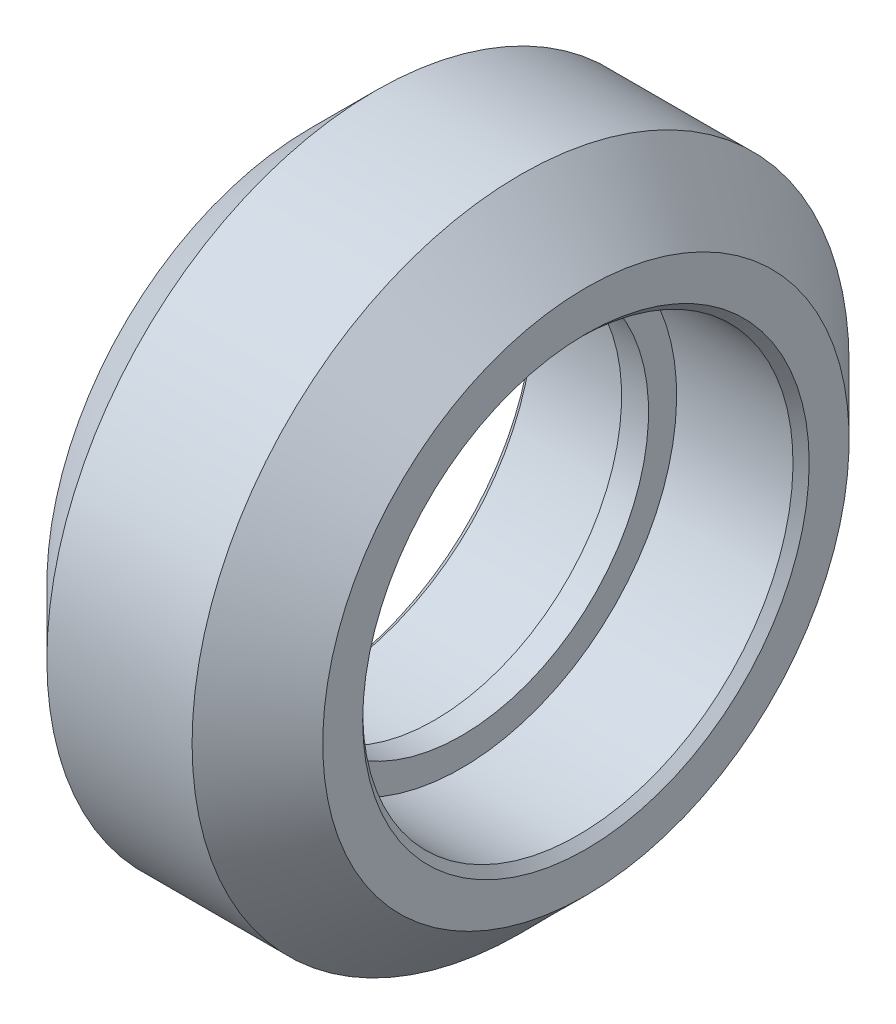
ISO-10303-21;
HEADER;
FILE_DESCRIPTION(('STEP AP214'),'2;1');
FILE_NAME('part.step','',(''),(''),'','','');
FILE_SCHEMA(('AUTOMOTIVE_DESIGN { 1 0 10303 214 1 1 1 1 }'));
ENDSEC;
DATA;
#1=APPLICATION_CONTEXT('core data for automotive mechanical design processes');
#2=APPLICATION_PROTOCOL_DEFINITION('international standard','automotive_design',2000,#1);
#3=PRODUCT_CONTEXT('',#1,'mechanical');
#4=PRODUCT('Part','Part','',(#3));
#5=PRODUCT_RELATED_PRODUCT_CATEGORY('part','',(#4));
#6=PRODUCT_DEFINITION_FORMATION('','',#4);
#7=PRODUCT_DEFINITION_CONTEXT('part definition',#1,'design');
#8=PRODUCT_DEFINITION('design','',#6,#7);
#9=PRODUCT_DEFINITION_SHAPE('','',#8);
#10=(LENGTH_UNIT() NAMED_UNIT(*) SI_UNIT(.MILLI.,.METRE.));
#11=(NAMED_UNIT(*) PLANE_ANGLE_UNIT() SI_UNIT($,.RADIAN.));
#12=(NAMED_UNIT(*) SI_UNIT($,.STERADIAN.) SOLID_ANGLE_UNIT());
#13=UNCERTAINTY_MEASURE_WITH_UNIT(LENGTH_MEASURE(1.E-05),#10,'distance_accuracy_value','');
#14=(GEOMETRIC_REPRESENTATION_CONTEXT(3) GLOBAL_UNCERTAINTY_ASSIGNED_CONTEXT((#13)) GLOBAL_UNIT_ASSIGNED_CONTEXT((#10,
#11,#12)) REPRESENTATION_CONTEXT('',''));
#15=CARTESIAN_POINT('',(0.,0.,0.));
#16=DIRECTION('',(0.,0.,1.));
#17=DIRECTION('',(1.,0.,0.));
#18=AXIS2_PLACEMENT_3D('',#15,#16,#17);
#19=CARTESIAN_POINT('',(-0.25,0.,0.));
#20=DIRECTION('',(-1.,0.,0.));
#21=DIRECTION('',(0.,1.,0.));
#22=AXIS2_PLACEMENT_3D('',#19,#20,#21);
#23=CYLINDRICAL_SURFACE('',#22,6.945);
#24=CARTESIAN_POINT('',(-0.499999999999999,0.,0.));
#25=DIRECTION('',(1.,0.,0.));
#26=DIRECTION('',(0.,1.,0.));
#27=AXIS2_PLACEMENT_3D('',#24,#25,#26);
#28=CIRCLE('',#27,6.945);
#29=CARTESIAN_POINT('',(-0.499999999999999,6.945,0.));
#30=VERTEX_POINT('',#29);
#31=EDGE_CURVE('E26',#30,#30,#28,.T.);
#32=ORIENTED_EDGE('',*,*,#31,.F.);
#33=EDGE_LOOP('',(#32));
#34=FACE_BOUND('',#33,.T.);
#35=CARTESIAN_POINT('',(0.499999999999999,0.,0.));
#36=DIRECTION('',(1.,0.,0.));
#37=DIRECTION('',(0.,1.,0.));
#38=AXIS2_PLACEMENT_3D('',#35,#36,#37);
#39=CIRCLE('',#38,6.945);
#40=CARTESIAN_POINT('',(0.499999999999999,6.945,0.));
#41=VERTEX_POINT('',#40);
#42=EDGE_CURVE('E11',#41,#41,#39,.T.);
#43=ORIENTED_EDGE('',*,*,#42,.T.);
#44=EDGE_LOOP('',(#43));
#45=FACE_BOUND('',#44,.T.);
#46=ADVANCED_FACE('F16',(#34,#45),#23,.F.);
#47=CARTESIAN_POINT('',(-0.499999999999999,7.466,0.));
#48=DIRECTION('',(-1.,0.,0.));
#49=DIRECTION('',(0.,0.707106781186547,0.707106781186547));
#50=AXIS2_PLACEMENT_3D('',#47,#48,#49);
#51=PLANE('',#50);
#52=CARTESIAN_POINT('',(-0.499999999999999,0.,0.));
#53=DIRECTION('',(1.,0.,0.));
#54=DIRECTION('',(0.,1.,0.));
#55=AXIS2_PLACEMENT_3D('',#52,#53,#54);
#56=CIRCLE('',#55,7.987);
#57=CARTESIAN_POINT('',(-0.499999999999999,7.987,0.));
#58=VERTEX_POINT('',#57);
#59=EDGE_CURVE('E256',#58,#58,#56,.T.);
#60=ORIENTED_EDGE('',*,*,#59,.F.);
#61=EDGE_LOOP('',(#60));
#62=FACE_BOUND('',#61,.T.);
#63=ORIENTED_EDGE('',*,*,#31,.T.);
#64=EDGE_LOOP('',(#63));
#65=FACE_BOUND('',#64,.T.);
#66=ADVANCED_FACE('F108',(#62,#65),#51,.T.);
#67=CARTESIAN_POINT('',(-2.66,0.,0.));
#68=DIRECTION('',(-1.,0.,0.));
#69=DIRECTION('',(0.,1.,0.));
#70=AXIS2_PLACEMENT_3D('',#67,#68,#69);
#71=CYLINDRICAL_SURFACE('',#70,7.987);
#72=CARTESIAN_POINT('',(-4.82,0.,0.));
#73=DIRECTION('',(1.,0.,0.));
#74=DIRECTION('',(0.,1.,0.));
#75=AXIS2_PLACEMENT_3D('',#72,#73,#74);
#76=CIRCLE('',#75,7.987);
#77=CARTESIAN_POINT('',(-4.82,7.987,0.));
#78=VERTEX_POINT('',#77);
#79=EDGE_CURVE('E253',#78,#78,#76,.T.);
#80=ORIENTED_EDGE('',*,*,#79,.F.);
#81=EDGE_LOOP('',(#80));
#82=FACE_BOUND('',#81,.T.);
#83=ORIENTED_EDGE('',*,*,#59,.T.);
#84=EDGE_LOOP('',(#83));
#85=FACE_BOUND('',#84,.T.);
#86=ADVANCED_FACE('F113',(#82,#85),#71,.F.);
#87=CARTESIAN_POINT('',(-4.97,0.,0.));
#88=DIRECTION('',(-1.,0.,0.));
#89=DIRECTION('',(0.,1.,0.));
#90=AXIS2_PLACEMENT_3D('',#87,#88,#89);
#91=CONICAL_SURFACE('',#90,8.137,0.785398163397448);
#92=CARTESIAN_POINT('',(-5.12,0.,0.));
#93=DIRECTION('',(1.,0.,0.));
#94=DIRECTION('',(0.,1.,0.));
#95=AXIS2_PLACEMENT_3D('',#92,#93,#94);
#96=CIRCLE('',#95,8.287);
#97=CARTESIAN_POINT('',(-5.12,8.287,0.));
#98=VERTEX_POINT('',#97);
#99=EDGE_CURVE('E251',#98,#98,#96,.T.);
#100=ORIENTED_EDGE('',*,*,#99,.F.);
#101=EDGE_LOOP('',(#100));
#102=FACE_BOUND('',#101,.T.);
#103=ORIENTED_EDGE('',*,*,#79,.T.);
#104=EDGE_LOOP('',(#103));
#105=FACE_BOUND('',#104,.T.);
#106=ADVANCED_FACE('F120',(#102,#105),#91,.F.);
#107=CARTESIAN_POINT('',(-5.12,9.0285,0.));
#108=DIRECTION('',(-1.,0.,0.));
#109=DIRECTION('',(0.,0.707106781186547,0.707106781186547));
#110=AXIS2_PLACEMENT_3D('',#107,#108,#109);
#111=PLANE('',#110);
#112=CARTESIAN_POINT('',(-5.12,0.,0.));
#113=DIRECTION('',(1.,0.,0.));
#114=DIRECTION('',(0.,1.,0.));
#115=AXIS2_PLACEMENT_3D('',#112,#113,#114);
#116=CIRCLE('',#115,9.77);
#117=CARTESIAN_POINT('',(-5.12,9.77,0.));
#118=VERTEX_POINT('',#117);
#119=EDGE_CURVE('E77',#118,#118,#116,.T.);
#120=ORIENTED_EDGE('',*,*,#119,.F.);
#121=EDGE_LOOP('',(#120));
#122=FACE_BOUND('',#121,.T.);
#123=ORIENTED_EDGE('',*,*,#99,.T.);
#124=EDGE_LOOP('',(#123));
#125=FACE_BOUND('',#124,.T.);
#126=ADVANCED_FACE('F124',(#122,#125),#111,.T.);
#127=CARTESIAN_POINT('',(-3.9075,0.,0.));
#128=DIRECTION('',(1.,0.,0.));
#129=DIRECTION('',(0.,1.,0.));
#130=AXIS2_PLACEMENT_3D('',#127,#128,#129);
#131=CONICAL_SURFACE('',#130,10.9825,0.785398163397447);
#132=CARTESIAN_POINT('',(-2.69499999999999,0.,0.));
#133=DIRECTION('',(1.,0.,0.));
#134=DIRECTION('',(0.,1.,0.));
#135=AXIS2_PLACEMENT_3D('',#132,#133,#134);
#136=CIRCLE('',#135,12.195);
#137=CARTESIAN_POINT('',(-2.69499999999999,12.195,0.));
#138=VERTEX_POINT('',#137);
#139=EDGE_CURVE('E70',#138,#138,#136,.T.);
#140=ORIENTED_EDGE('',*,*,#139,.F.);
#141=EDGE_LOOP('',(#140));
#142=FACE_BOUND('',#141,.T.);
#143=ORIENTED_EDGE('',*,*,#119,.T.);
#144=EDGE_LOOP('',(#143));
#145=FACE_BOUND('',#144,.T.);
#146=ADVANCED_FACE('F97',(#142,#145),#131,.T.);
#147=CARTESIAN_POINT('',(3.9075,0.,0.));
#148=DIRECTION('',(-1.,0.,0.));
#149=DIRECTION('',(0.,1.,0.));
#150=AXIS2_PLACEMENT_3D('',#147,#148,#149);
#151=CONICAL_SURFACE('',#150,10.9825,0.785398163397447);
#152=CARTESIAN_POINT('',(5.12,0.,0.));
#153=DIRECTION('',(1.,0.,0.));
#154=DIRECTION('',(0.,1.,0.));
#155=AXIS2_PLACEMENT_3D('',#152,#153,#154);
#156=CIRCLE('',#155,9.77);
#157=CARTESIAN_POINT('',(5.12,9.77,0.));
#158=VERTEX_POINT('',#157);
#159=EDGE_CURVE('E79',#158,#158,#156,.T.);
#160=ORIENTED_EDGE('',*,*,#159,.F.);
#161=EDGE_LOOP('',(#160));
#162=FACE_BOUND('',#161,.T.);
#163=CARTESIAN_POINT('',(2.69499999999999,0.,0.));
#164=DIRECTION('',(1.,0.,0.));
#165=DIRECTION('',(0.,1.,0.));
#166=AXIS2_PLACEMENT_3D('',#163,#164,#165);
#167=CIRCLE('',#166,12.195);
#168=CARTESIAN_POINT('',(2.69499999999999,12.195,0.));
#169=VERTEX_POINT('',#168);
#170=EDGE_CURVE('E82',#169,#169,#167,.T.);
#171=ORIENTED_EDGE('',*,*,#170,.T.);
#172=EDGE_LOOP('',(#171));
#173=FACE_BOUND('',#172,.T.);
#174=ADVANCED_FACE('F92',(#162,#173),#151,.T.);
#175=CARTESIAN_POINT('',(5.12,9.0285,0.));
#176=DIRECTION('',(1.,0.,0.));
#177=DIRECTION('',(0.,0.707106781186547,0.707106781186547));
#178=AXIS2_PLACEMENT_3D('',#175,#176,#177);
#179=PLANE('',#178);
#180=CARTESIAN_POINT('',(5.12,0.,0.));
#181=DIRECTION('',(1.,0.,0.));
#182=DIRECTION('',(0.,1.,0.));
#183=AXIS2_PLACEMENT_3D('',#180,#181,#182);
#184=CIRCLE('',#183,8.287);
#185=CARTESIAN_POINT('',(5.12,8.287,0.));
#186=VERTEX_POINT('',#185);
#187=EDGE_CURVE('E71',#186,#186,#184,.T.);
#188=ORIENTED_EDGE('',*,*,#187,.F.);
#189=EDGE_LOOP('',(#188));
#190=FACE_BOUND('',#189,.T.);
#191=ORIENTED_EDGE('',*,*,#159,.T.);
#192=EDGE_LOOP('',(#191));
#193=FACE_BOUND('',#192,.T.);
#194=ADVANCED_FACE('F89',(#190,#193),#179,.T.);
#195=CARTESIAN_POINT('',(4.97,0.,0.));
#196=DIRECTION('',(1.,0.,0.));
#197=DIRECTION('',(0.,1.,0.));
#198=AXIS2_PLACEMENT_3D('',#195,#196,#197);
#199=CONICAL_SURFACE('',#198,8.137,0.785398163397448);
#200=CARTESIAN_POINT('',(4.82,0.,0.));
#201=DIRECTION('',(1.,0.,0.));
#202=DIRECTION('',(0.,1.,0.));
#203=AXIS2_PLACEMENT_3D('',#200,#201,#202);
#204=CIRCLE('',#203,7.987);
#205=CARTESIAN_POINT('',(4.82,7.987,0.));
#206=VERTEX_POINT('',#205);
#207=EDGE_CURVE('E63',#206,#206,#204,.T.);
#208=ORIENTED_EDGE('',*,*,#207,.F.);
#209=EDGE_LOOP('',(#208));
#210=FACE_BOUND('',#209,.T.);
#211=ORIENTED_EDGE('',*,*,#187,.T.);
#212=EDGE_LOOP('',(#211));
#213=FACE_BOUND('',#212,.T.);
#214=ADVANCED_FACE('F87',(#210,#213),#199,.F.);
#215=CARTESIAN_POINT('',(2.66,0.,0.));
#216=DIRECTION('',(-1.,0.,0.));
#217=DIRECTION('',(0.,1.,0.));
#218=AXIS2_PLACEMENT_3D('',#215,#216,#217);
#219=CYLINDRICAL_SURFACE('',#218,7.987);
#220=CARTESIAN_POINT('',(0.499999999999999,0.,0.));
#221=DIRECTION('',(1.,0.,0.));
#222=DIRECTION('',(0.,1.,0.));
#223=AXIS2_PLACEMENT_3D('',#220,#221,#222);
#224=CIRCLE('',#223,7.987);
#225=CARTESIAN_POINT('',(0.499999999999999,7.987,0.));
#226=VERTEX_POINT('',#225);
#227=EDGE_CURVE('E20',#226,#226,#224,.T.);
#228=ORIENTED_EDGE('',*,*,#227,.F.);
#229=EDGE_LOOP('',(#228));
#230=FACE_BOUND('',#229,.T.);
#231=ORIENTED_EDGE('',*,*,#207,.T.);
#232=EDGE_LOOP('',(#231));
#233=FACE_BOUND('',#232,.T.);
#234=ADVANCED_FACE('F67',(#230,#233),#219,.F.);
#235=CARTESIAN_POINT('',(0.499999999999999,7.466,0.));
#236=DIRECTION('',(1.,0.,0.));
#237=DIRECTION('',(0.,0.707106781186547,0.707106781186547));
#238=AXIS2_PLACEMENT_3D('',#235,#236,#237);
#239=PLANE('',#238);
#240=ORIENTED_EDGE('',*,*,#42,.F.);
#241=EDGE_LOOP('',(#240));
#242=FACE_BOUND('',#241,.T.);
#243=ORIENTED_EDGE('',*,*,#227,.T.);
#244=EDGE_LOOP('',(#243));
#245=FACE_BOUND('',#244,.T.);
#246=ADVANCED_FACE('F101',(#242,#245),#239,.T.);
#247=CARTESIAN_POINT('',(0.,0.,0.));
#248=DIRECTION('',(1.,0.,0.));
#249=DIRECTION('',(0.,1.,0.));
#250=AXIS2_PLACEMENT_3D('',#247,#248,#249);
#251=CYLINDRICAL_SURFACE('',#250,12.195);
#252=ORIENTED_EDGE('',*,*,#170,.F.);
#253=EDGE_LOOP('',(#252));
#254=FACE_BOUND('',#253,.T.);
#255=ORIENTED_EDGE('',*,*,#139,.T.);
#256=EDGE_LOOP('',(#255));
#257=FACE_BOUND('',#256,.T.);
#258=ADVANCED_FACE('F18',(#254,#257),#251,.T.);
#259=CLOSED_SHELL('',(#46,#66,#86,#106,#126,#146,#174,#194,#214,#234,#246,#258));
#260=MANIFOLD_SOLID_BREP('B1',#259);
#261=ADVANCED_BREP_SHAPE_REPRESENTATION('',(#18,#260),#14);
#262=SHAPE_DEFINITION_REPRESENTATION(#9,#261);
ENDSEC;
END-ISO-10303-21;
